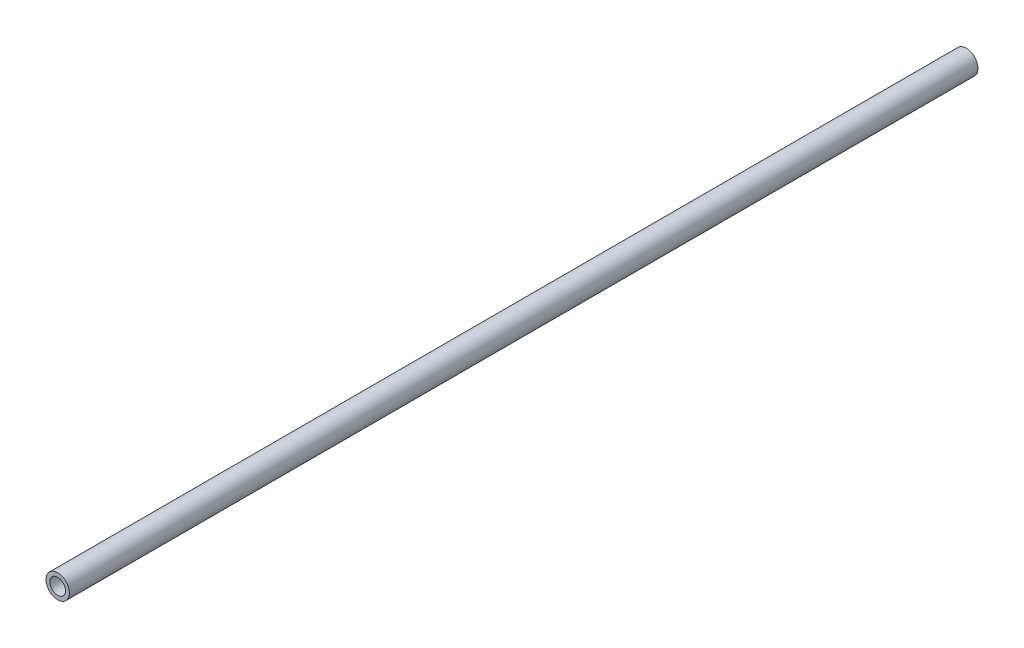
ISO-10303-21;
HEADER;
FILE_DESCRIPTION(('STEP AP214'),'2;1');
FILE_NAME('part.step','',(''),(''),'','','');
FILE_SCHEMA(('AUTOMOTIVE_DESIGN { 1 0 10303 214 1 1 1 1 }'));
ENDSEC;
DATA;
#1=APPLICATION_CONTEXT('core data for automotive mechanical design processes');
#2=APPLICATION_PROTOCOL_DEFINITION('international standard','automotive_design',2000,#1);
#3=PRODUCT_CONTEXT('',#1,'mechanical');
#4=PRODUCT('Part','Part','',(#3));
#5=PRODUCT_RELATED_PRODUCT_CATEGORY('part','',(#4));
#6=PRODUCT_DEFINITION_FORMATION('','',#4);
#7=PRODUCT_DEFINITION_CONTEXT('part definition',#1,'design');
#8=PRODUCT_DEFINITION('design','',#6,#7);
#9=PRODUCT_DEFINITION_SHAPE('','',#8);
#10=(LENGTH_UNIT() NAMED_UNIT(*) SI_UNIT(.MILLI.,.METRE.));
#11=(NAMED_UNIT(*) PLANE_ANGLE_UNIT() SI_UNIT($,.RADIAN.));
#12=(NAMED_UNIT(*) SI_UNIT($,.STERADIAN.) SOLID_ANGLE_UNIT());
#13=UNCERTAINTY_MEASURE_WITH_UNIT(LENGTH_MEASURE(1.E-05),#10,'distance_accuracy_value','');
#14=(GEOMETRIC_REPRESENTATION_CONTEXT(3) GLOBAL_UNCERTAINTY_ASSIGNED_CONTEXT((#13)) GLOBAL_UNIT_ASSIGNED_CONTEXT((#10,
#11,#12)) REPRESENTATION_CONTEXT('',''));
#15=CARTESIAN_POINT('',(0.,0.,0.));
#16=DIRECTION('',(0.,0.,1.));
#17=DIRECTION('',(1.,0.,0.));
#18=AXIS2_PLACEMENT_3D('',#15,#16,#17);
#19=CARTESIAN_POINT('',(0.,0.,116.4));
#20=DIRECTION('',(0.,0.,1.));
#21=DIRECTION('',(1.,0.,0.));
#22=AXIS2_PLACEMENT_3D('',#19,#20,#21);
#23=PLANE('',#22);
#24=CARTESIAN_POINT('',(0.,0.,116.4));
#25=DIRECTION('',(0.,0.,1.));
#26=DIRECTION('',(1.,0.,0.));
#27=AXIS2_PLACEMENT_3D('',#24,#25,#26);
#28=CIRCLE('',#27,3.);
#29=CARTESIAN_POINT('',(3.,0.,116.4));
#30=VERTEX_POINT('',#29);
#31=EDGE_CURVE('E10',#30,#30,#28,.T.);
#32=ORIENTED_EDGE('',*,*,#31,.T.);
#33=EDGE_LOOP('',(#32));
#34=FACE_BOUND('',#33,.T.);
#35=CARTESIAN_POINT('',(0.,0.,116.4));
#36=DIRECTION('',(0.,0.,1.));
#37=DIRECTION('',(1.,0.,0.));
#38=AXIS2_PLACEMENT_3D('',#35,#36,#37);
#39=CIRCLE('',#38,2.);
#40=CARTESIAN_POINT('',(2.,0.,116.4));
#41=VERTEX_POINT('',#40);
#42=EDGE_CURVE('E42',#41,#41,#39,.T.);
#43=ORIENTED_EDGE('',*,*,#42,.F.);
#44=EDGE_LOOP('',(#43));
#45=FACE_BOUND('',#44,.T.);
#46=ADVANCED_FACE('F31',(#34,#45),#23,.T.);
#47=CARTESIAN_POINT('',(0.,0.,-116.4));
#48=DIRECTION('',(0.,0.,1.));
#49=DIRECTION('',(1.,0.,0.));
#50=AXIS2_PLACEMENT_3D('',#47,#48,#49);
#51=PLANE('',#50);
#52=CARTESIAN_POINT('',(0.,0.,-116.4));
#53=DIRECTION('',(0.,0.,1.));
#54=DIRECTION('',(1.,0.,0.));
#55=AXIS2_PLACEMENT_3D('',#52,#53,#54);
#56=CIRCLE('',#55,3.);
#57=CARTESIAN_POINT('',(3.,0.,-116.4));
#58=VERTEX_POINT('',#57);
#59=EDGE_CURVE('E35',#58,#58,#56,.T.);
#60=ORIENTED_EDGE('',*,*,#59,.F.);
#61=EDGE_LOOP('',(#60));
#62=FACE_BOUND('',#61,.T.);
#63=CARTESIAN_POINT('',(0.,0.,-116.4));
#64=DIRECTION('',(0.,0.,1.));
#65=DIRECTION('',(1.,0.,0.));
#66=AXIS2_PLACEMENT_3D('',#63,#64,#65);
#67=CIRCLE('',#66,2.);
#68=CARTESIAN_POINT('',(2.,0.,-116.4));
#69=VERTEX_POINT('',#68);
#70=EDGE_CURVE('E44',#69,#69,#67,.T.);
#71=ORIENTED_EDGE('',*,*,#70,.T.);
#72=EDGE_LOOP('',(#71));
#73=FACE_BOUND('',#72,.T.);
#74=ADVANCED_FACE('F54',(#62,#73),#51,.F.);
#75=CARTESIAN_POINT('',(0.,0.,116.4));
#76=DIRECTION('',(0.,0.,-1.));
#77=DIRECTION('',(-1.,0.,0.));
#78=AXIS2_PLACEMENT_3D('',#75,#76,#77);
#79=CYLINDRICAL_SURFACE('',#78,3.);
#80=ORIENTED_EDGE('',*,*,#31,.F.);
#81=EDGE_LOOP('',(#80));
#82=FACE_BOUND('',#81,.T.);
#83=ORIENTED_EDGE('',*,*,#59,.T.);
#84=EDGE_LOOP('',(#83));
#85=FACE_BOUND('',#84,.T.);
#86=ADVANCED_FACE('F33',(#82,#85),#79,.T.);
#87=CARTESIAN_POINT('',(0.,0.,116.4));
#88=DIRECTION('',(0.,0.,-1.));
#89=DIRECTION('',(-1.,0.,0.));
#90=AXIS2_PLACEMENT_3D('',#87,#88,#89);
#91=CYLINDRICAL_SURFACE('',#90,2.);
#92=ORIENTED_EDGE('',*,*,#42,.T.);
#93=EDGE_LOOP('',(#92));
#94=FACE_BOUND('',#93,.T.);
#95=ORIENTED_EDGE('',*,*,#70,.F.);
#96=EDGE_LOOP('',(#95));
#97=FACE_BOUND('',#96,.T.);
#98=ADVANCED_FACE('F50',(#94,#97),#91,.F.);
#99=CLOSED_SHELL('',(#46,#74,#86,#98));
#100=MANIFOLD_SOLID_BREP('B2',#99);
#101=ADVANCED_BREP_SHAPE_REPRESENTATION('',(#18,#100),#14);
#102=SHAPE_DEFINITION_REPRESENTATION(#9,#101);
ENDSEC;
END-ISO-10303-21;
